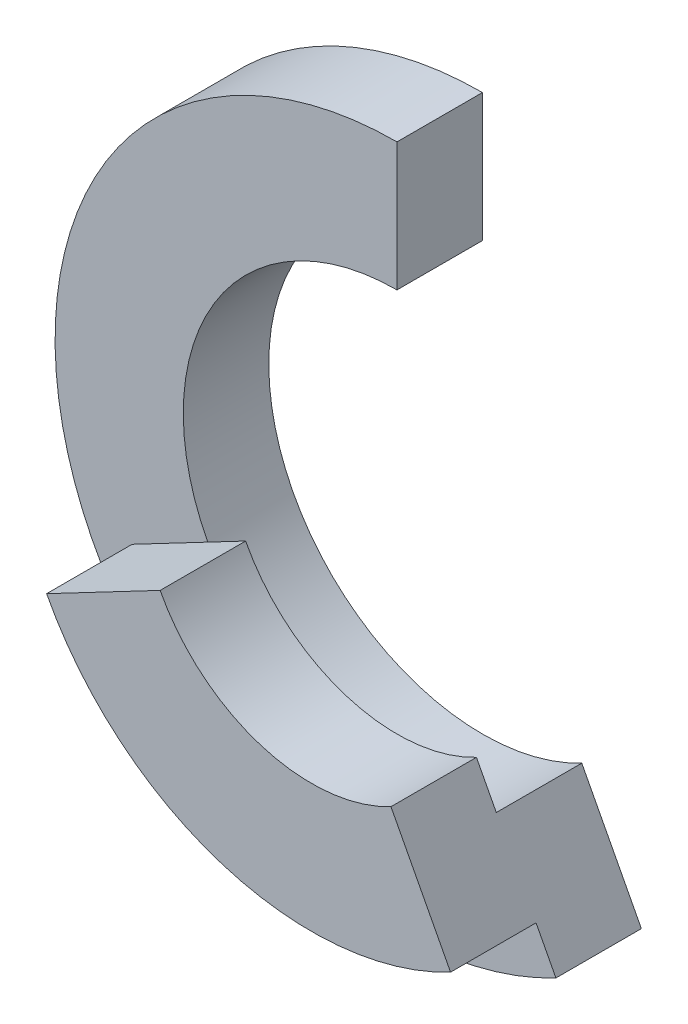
ISO-10303-21;
HEADER;
FILE_DESCRIPTION(('STEP AP214'),'2;1');
FILE_NAME('part.step','',(''),(''),'','','');
FILE_SCHEMA(('AUTOMOTIVE_DESIGN { 1 0 10303 214 1 1 1 1 }'));
ENDSEC;
DATA;
#1=APPLICATION_CONTEXT('core data for automotive mechanical design processes');
#2=APPLICATION_PROTOCOL_DEFINITION('international standard','automotive_design',2000,#1);
#3=PRODUCT_CONTEXT('',#1,'mechanical');
#4=PRODUCT('Part','Part','',(#3));
#5=PRODUCT_RELATED_PRODUCT_CATEGORY('part','',(#4));
#6=PRODUCT_DEFINITION_FORMATION('','',#4);
#7=PRODUCT_DEFINITION_CONTEXT('part definition',#1,'design');
#8=PRODUCT_DEFINITION('design','',#6,#7);
#9=PRODUCT_DEFINITION_SHAPE('','',#8);
#10=(LENGTH_UNIT() NAMED_UNIT(*) SI_UNIT(.MILLI.,.METRE.));
#11=(NAMED_UNIT(*) PLANE_ANGLE_UNIT() SI_UNIT($,.RADIAN.));
#12=(NAMED_UNIT(*) SI_UNIT($,.STERADIAN.) SOLID_ANGLE_UNIT());
#13=UNCERTAINTY_MEASURE_WITH_UNIT(LENGTH_MEASURE(1.E-05),#10,'distance_accuracy_value','');
#14=(GEOMETRIC_REPRESENTATION_CONTEXT(3) GLOBAL_UNCERTAINTY_ASSIGNED_CONTEXT((#13)) GLOBAL_UNIT_ASSIGNED_CONTEXT((#10,
#11,#12)) REPRESENTATION_CONTEXT('',''));
#15=CARTESIAN_POINT('',(0.,0.,0.));
#16=DIRECTION('',(0.,0.,1.));
#17=DIRECTION('',(1.,0.,0.));
#18=AXIS2_PLACEMENT_3D('',#15,#16,#17);
#19=CARTESIAN_POINT('',(0.,0.,0.));
#20=DIRECTION('',(0.,0.,1.));
#21=DIRECTION('',(1.,0.,0.));
#22=AXIS2_PLACEMENT_3D('',#19,#20,#21);
#23=PLANE('',#22);
#24=DIRECTION('',(0.464798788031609,-0.88541633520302,0.));
#25=VECTOR('',#24,1.);
#26=CARTESIAN_POINT('',(11.6199697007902,-22.1354083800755,0.));
#27=LINE('',#26,#25);
#28=CARTESIAN_POINT('',(16.2679575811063,-30.9895717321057,0.));
#29=VERTEX_POINT('',#28);
#30=CARTESIAN_POINT('',(18.5919515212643,-35.4166534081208,0.));
#31=VERTEX_POINT('',#30);
#32=EDGE_CURVE('E139',#29,#31,#27,.T.);
#33=ORIENTED_EDGE('',*,*,#32,.F.);
#34=CARTESIAN_POINT('',(0.,0.,0.));
#35=DIRECTION('',(0.,0.,1.));
#36=DIRECTION('',(1.,0.,0.));
#37=AXIS2_PLACEMENT_3D('',#34,#35,#36);
#38=CIRCLE('',#37,35.);
#39=CARTESIAN_POINT('',(-30.9895717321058,-16.2679575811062,0.));
#40=VERTEX_POINT('',#39);
#41=EDGE_CURVE('E124',#29,#40,#38,.F.);
#42=ORIENTED_EDGE('',*,*,#41,.T.);
#43=DIRECTION('',(0.885416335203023,0.464798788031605,0.));
#44=VECTOR('',#43,1.);
#45=CARTESIAN_POINT('',(-30.9895717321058,-16.2679575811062,0.));
#46=LINE('',#45,#44);
#47=CARTESIAN_POINT('',(-22.1354083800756,-11.6199697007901,0.));
#48=VERTEX_POINT('',#47);
#49=EDGE_CURVE('E107',#40,#48,#46,.T.);
#50=ORIENTED_EDGE('',*,*,#49,.T.);
#51=CARTESIAN_POINT('',(0.,0.,0.));
#52=DIRECTION('',(0.,0.,1.));
#53=DIRECTION('',(1.,0.,0.));
#54=AXIS2_PLACEMENT_3D('',#51,#52,#53);
#55=CIRCLE('',#54,25.);
#56=CARTESIAN_POINT('',(0.,25.,0.));
#57=VERTEX_POINT('',#56);
#58=EDGE_CURVE('E117',#48,#57,#55,.F.);
#59=ORIENTED_EDGE('',*,*,#58,.T.);
#60=DIRECTION('',(0.,-1.,0.));
#61=VECTOR('',#60,1.);
#62=CARTESIAN_POINT('',(0.,40.,0.));
#63=LINE('',#62,#61);
#64=CARTESIAN_POINT('',(0.,40.,0.));
#65=VERTEX_POINT('',#64);
#66=EDGE_CURVE('E134',#65,#57,#63,.T.);
#67=ORIENTED_EDGE('',*,*,#66,.F.);
#68=CARTESIAN_POINT('',(0.,0.,0.));
#69=DIRECTION('',(0.,0.,-1.));
#70=DIRECTION('',(-1.,0.,0.));
#71=AXIS2_PLACEMENT_3D('',#68,#69,#70);
#72=CIRCLE('',#71,40.);
#73=EDGE_CURVE('E137',#31,#65,#72,.T.);
#74=ORIENTED_EDGE('',*,*,#73,.F.);
#75=EDGE_LOOP('',(#33,#42,#50,#59,#67,#74));
#76=FACE_BOUND('',#75,.T.);
#77=ADVANCED_FACE('F31',(#76),#23,.T.);
#78=CARTESIAN_POINT('',(0.,0.,-10.));
#79=DIRECTION('',(0.,0.,1.));
#80=DIRECTION('',(1.,0.,0.));
#81=AXIS2_PLACEMENT_3D('',#78,#79,#80);
#82=CYLINDRICAL_SURFACE('',#81,25.);
#83=CARTESIAN_POINT('',(11.6199697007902,-22.1354083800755,0.));
#84=VERTEX_POINT('',#83);
#85=EDGE_CURVE('E35',#84,#48,#55,.F.);
#86=ORIENTED_EDGE('',*,*,#85,.F.);
#87=DIRECTION('',(0.,0.,1.));
#88=VECTOR('',#87,1.);
#89=CARTESIAN_POINT('',(11.6199697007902,-22.1354083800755,-10.));
#90=LINE('',#89,#88);
#91=CARTESIAN_POINT('',(11.6199697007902,-22.1354083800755,-10.));
#92=VERTEX_POINT('',#91);
#93=EDGE_CURVE('E11',#92,#84,#90,.T.);
#94=ORIENTED_EDGE('',*,*,#93,.F.);
#95=CARTESIAN_POINT('',(0.,0.,-10.));
#96=DIRECTION('',(0.,0.,1.));
#97=DIRECTION('',(1.,0.,0.));
#98=AXIS2_PLACEMENT_3D('',#95,#96,#97);
#99=CIRCLE('',#98,25.);
#100=CARTESIAN_POINT('',(0.,25.,-10.));
#101=VERTEX_POINT('',#100);
#102=EDGE_CURVE('E142',#92,#101,#99,.F.);
#103=ORIENTED_EDGE('',*,*,#102,.T.);
#104=DIRECTION('',(0.,0.,1.));
#105=VECTOR('',#104,1.);
#106=CARTESIAN_POINT('',(0.,25.,-10.));
#107=LINE('',#106,#105);
#108=EDGE_CURVE('E147',#101,#57,#107,.T.);
#109=ORIENTED_EDGE('',*,*,#108,.T.);
#110=ORIENTED_EDGE('',*,*,#58,.F.);
#111=EDGE_LOOP('',(#86,#94,#103,#109,#110));
#112=FACE_BOUND('',#111,.T.);
#113=ADVANCED_FACE('F33',(#112),#82,.F.);
#114=CARTESIAN_POINT('',(11.6199697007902,-22.1354083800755,-10.));
#115=DIRECTION('',(-0.885416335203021,-0.464798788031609,0.));
#116=DIRECTION('',(0.464798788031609,-0.88541633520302,0.));
#117=AXIS2_PLACEMENT_3D('',#114,#115,#116);
#118=PLANE('',#117);
#119=ORIENTED_EDGE('',*,*,#93,.T.);
#120=DIRECTION('',(0.464798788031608,-0.885416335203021,0.));
#121=VECTOR('',#120,1.);
#122=CARTESIAN_POINT('',(9.29597576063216,-17.7083267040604,0.));
#123=LINE('',#122,#121);
#124=CARTESIAN_POINT('',(9.29597576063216,-17.7083267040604,0.));
#125=VERTEX_POINT('',#124);
#126=EDGE_CURVE('E130',#125,#84,#123,.T.);
#127=ORIENTED_EDGE('',*,*,#126,.F.);
#128=DIRECTION('',(0.,0.,-1.));
#129=VECTOR('',#128,1.);
#130=CARTESIAN_POINT('',(9.29597576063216,-17.7083267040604,10.));
#131=LINE('',#130,#129);
#132=CARTESIAN_POINT('',(9.29597576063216,-17.7083267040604,10.));
#133=VERTEX_POINT('',#132);
#134=EDGE_CURVE('E121',#133,#125,#131,.T.);
#135=ORIENTED_EDGE('',*,*,#134,.F.);
#136=DIRECTION('',(0.464798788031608,-0.885416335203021,0.));
#137=VECTOR('',#136,1.);
#138=CARTESIAN_POINT('',(9.29597576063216,-17.7083267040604,10.));
#139=LINE('',#138,#137);
#140=CARTESIAN_POINT('',(16.2679575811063,-30.9895717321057,10.));
#141=VERTEX_POINT('',#140);
#142=EDGE_CURVE('E169',#133,#141,#139,.T.);
#143=ORIENTED_EDGE('',*,*,#142,.T.);
#144=DIRECTION('',(0.,0.,-1.));
#145=VECTOR('',#144,1.);
#146=CARTESIAN_POINT('',(16.2679575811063,-30.9895717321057,10.));
#147=LINE('',#146,#145);
#148=EDGE_CURVE('E149',#141,#29,#147,.T.);
#149=ORIENTED_EDGE('',*,*,#148,.T.);
#150=ORIENTED_EDGE('',*,*,#32,.T.);
#151=DIRECTION('',(0.,0.,1.));
#152=VECTOR('',#151,1.);
#153=CARTESIAN_POINT('',(18.5919515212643,-35.4166534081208,-10.));
#154=LINE('',#153,#152);
#155=CARTESIAN_POINT('',(18.5919515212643,-35.4166534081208,-10.));
#156=VERTEX_POINT('',#155);
#157=EDGE_CURVE('E41',#156,#31,#154,.T.);
#158=ORIENTED_EDGE('',*,*,#157,.F.);
#159=DIRECTION('',(0.464798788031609,-0.88541633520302,0.));
#160=VECTOR('',#159,1.);
#161=CARTESIAN_POINT('',(11.6199697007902,-22.1354083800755,-10.));
#162=LINE('',#161,#160);
#163=EDGE_CURVE('E178',#92,#156,#162,.T.);
#164=ORIENTED_EDGE('',*,*,#163,.F.);
#165=EDGE_LOOP('',(#119,#127,#135,#143,#149,#150,#158,#164));
#166=FACE_BOUND('',#165,.T.);
#167=ADVANCED_FACE('F176',(#166),#118,.F.);
#168=CARTESIAN_POINT('',(0.,0.,-10.));
#169=DIRECTION('',(0.,0.,1.));
#170=DIRECTION('',(1.,0.,0.));
#171=AXIS2_PLACEMENT_3D('',#168,#169,#170);
#172=CYLINDRICAL_SURFACE('',#171,40.);
#173=ORIENTED_EDGE('',*,*,#73,.T.);
#174=DIRECTION('',(0.,0.,1.));
#175=VECTOR('',#174,1.);
#176=CARTESIAN_POINT('',(0.,40.,-10.));
#177=LINE('',#176,#175);
#178=CARTESIAN_POINT('',(0.,40.,-10.));
#179=VERTEX_POINT('',#178);
#180=EDGE_CURVE('E188',#179,#65,#177,.T.);
#181=ORIENTED_EDGE('',*,*,#180,.F.);
#182=CARTESIAN_POINT('',(0.,0.,-10.));
#183=DIRECTION('',(0.,0.,-1.));
#184=DIRECTION('',(-1.,0.,0.));
#185=AXIS2_PLACEMENT_3D('',#182,#183,#184);
#186=CIRCLE('',#185,40.);
#187=EDGE_CURVE('E196',#156,#179,#186,.T.);
#188=ORIENTED_EDGE('',*,*,#187,.F.);
#189=ORIENTED_EDGE('',*,*,#157,.T.);
#190=EDGE_LOOP('',(#173,#181,#188,#189));
#191=FACE_BOUND('',#190,.T.);
#192=ADVANCED_FACE('F199',(#191),#172,.T.);
#193=CARTESIAN_POINT('',(0.,40.,-10.));
#194=DIRECTION('',(-1.,0.,0.));
#195=DIRECTION('',(0.,-1.,0.));
#196=AXIS2_PLACEMENT_3D('',#193,#194,#195);
#197=PLANE('',#196);
#198=ORIENTED_EDGE('',*,*,#66,.T.);
#199=ORIENTED_EDGE('',*,*,#108,.F.);
#200=DIRECTION('',(0.,-1.,0.));
#201=VECTOR('',#200,1.);
#202=CARTESIAN_POINT('',(0.,40.,-10.));
#203=LINE('',#202,#201);
#204=EDGE_CURVE('E189',#179,#101,#203,.T.);
#205=ORIENTED_EDGE('',*,*,#204,.F.);
#206=ORIENTED_EDGE('',*,*,#180,.T.);
#207=EDGE_LOOP('',(#198,#199,#205,#206));
#208=FACE_BOUND('',#207,.T.);
#209=ADVANCED_FACE('F185',(#208),#197,.F.);
#210=CARTESIAN_POINT('',(0.,0.,-10.));
#211=DIRECTION('',(0.,0.,1.));
#212=DIRECTION('',(1.,0.,0.));
#213=AXIS2_PLACEMENT_3D('',#210,#211,#212);
#214=PLANE('',#213);
#215=ORIENTED_EDGE('',*,*,#102,.F.);
#216=ORIENTED_EDGE('',*,*,#163,.T.);
#217=ORIENTED_EDGE('',*,*,#187,.T.);
#218=ORIENTED_EDGE('',*,*,#204,.T.);
#219=EDGE_LOOP('',(#215,#216,#217,#218));
#220=FACE_BOUND('',#219,.T.);
#221=ADVANCED_FACE('F198',(#220),#214,.F.);
#222=CARTESIAN_POINT('',(0.,0.,0.));
#223=DIRECTION('',(0.,0.,1.));
#224=DIRECTION('',(1.,0.,0.));
#225=AXIS2_PLACEMENT_3D('',#222,#223,#224);
#226=PLANE('',#225);
#227=ORIENTED_EDGE('',*,*,#126,.T.);
#228=ORIENTED_EDGE('',*,*,#85,.T.);
#229=CARTESIAN_POINT('',(-17.7083267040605,-9.2959757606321,0.));
#230=VERTEX_POINT('',#229);
#231=EDGE_CURVE('E49',#48,#230,#46,.T.);
#232=ORIENTED_EDGE('',*,*,#231,.T.);
#233=CARTESIAN_POINT('',(0.,0.,0.));
#234=DIRECTION('',(0.,0.,1.));
#235=DIRECTION('',(1.,0.,0.));
#236=AXIS2_PLACEMENT_3D('',#233,#234,#235);
#237=CIRCLE('',#236,20.);
#238=EDGE_CURVE('E104',#125,#230,#237,.F.);
#239=ORIENTED_EDGE('',*,*,#238,.F.);
#240=EDGE_LOOP('',(#227,#228,#232,#239));
#241=FACE_BOUND('',#240,.T.);
#242=ADVANCED_FACE('F102',(#241),#226,.F.);
#243=CARTESIAN_POINT('',(0.,0.,10.));
#244=DIRECTION('',(0.,0.,-1.));
#245=DIRECTION('',(-1.,0.,0.));
#246=AXIS2_PLACEMENT_3D('',#243,#244,#245);
#247=CYLINDRICAL_SURFACE('',#246,20.);
#248=ORIENTED_EDGE('',*,*,#238,.T.);
#249=DIRECTION('',(0.,0.,-1.));
#250=VECTOR('',#249,1.);
#251=CARTESIAN_POINT('',(-17.7083267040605,-9.2959757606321,10.));
#252=LINE('',#251,#250);
#253=CARTESIAN_POINT('',(-17.7083267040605,-9.2959757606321,10.));
#254=VERTEX_POINT('',#253);
#255=EDGE_CURVE('E111',#254,#230,#252,.T.);
#256=ORIENTED_EDGE('',*,*,#255,.F.);
#257=CARTESIAN_POINT('',(0.,0.,10.));
#258=DIRECTION('',(0.,0.,1.));
#259=DIRECTION('',(1.,0.,0.));
#260=AXIS2_PLACEMENT_3D('',#257,#258,#259);
#261=CIRCLE('',#260,20.);
#262=EDGE_CURVE('E127',#133,#254,#261,.F.);
#263=ORIENTED_EDGE('',*,*,#262,.F.);
#264=ORIENTED_EDGE('',*,*,#134,.T.);
#265=EDGE_LOOP('',(#248,#256,#263,#264));
#266=FACE_BOUND('',#265,.T.);
#267=ADVANCED_FACE('F120',(#266),#247,.F.);
#268=CARTESIAN_POINT('',(-30.9895717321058,-16.2679575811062,10.));
#269=DIRECTION('',(-0.464798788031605,0.885416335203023,0.));
#270=DIRECTION('',(-0.885416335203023,-0.464798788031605,0.));
#271=AXIS2_PLACEMENT_3D('',#268,#269,#270);
#272=PLANE('',#271);
#273=ORIENTED_EDGE('',*,*,#49,.F.);
#274=DIRECTION('',(0.,0.,-1.));
#275=VECTOR('',#274,1.);
#276=CARTESIAN_POINT('',(-30.9895717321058,-16.2679575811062,10.));
#277=LINE('',#276,#275);
#278=CARTESIAN_POINT('',(-30.9895717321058,-16.2679575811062,10.));
#279=VERTEX_POINT('',#278);
#280=EDGE_CURVE('E118',#279,#40,#277,.T.);
#281=ORIENTED_EDGE('',*,*,#280,.F.);
#282=DIRECTION('',(0.885416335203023,0.464798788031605,0.));
#283=VECTOR('',#282,1.);
#284=CARTESIAN_POINT('',(-30.9895717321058,-16.2679575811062,10.));
#285=LINE('',#284,#283);
#286=EDGE_CURVE('E114',#279,#254,#285,.T.);
#287=ORIENTED_EDGE('',*,*,#286,.T.);
#288=ORIENTED_EDGE('',*,*,#255,.T.);
#289=ORIENTED_EDGE('',*,*,#231,.F.);
#290=EDGE_LOOP('',(#273,#281,#287,#288,#289));
#291=FACE_BOUND('',#290,.T.);
#292=ADVANCED_FACE('F112',(#291),#272,.T.);
#293=CARTESIAN_POINT('',(0.,0.,10.));
#294=DIRECTION('',(0.,0.,-1.));
#295=DIRECTION('',(-1.,0.,0.));
#296=AXIS2_PLACEMENT_3D('',#293,#294,#295);
#297=CYLINDRICAL_SURFACE('',#296,35.);
#298=ORIENTED_EDGE('',*,*,#41,.F.);
#299=ORIENTED_EDGE('',*,*,#148,.F.);
#300=CARTESIAN_POINT('',(0.,0.,10.));
#301=DIRECTION('',(0.,0.,1.));
#302=DIRECTION('',(1.,0.,0.));
#303=AXIS2_PLACEMENT_3D('',#300,#301,#302);
#304=CIRCLE('',#303,35.);
#305=EDGE_CURVE('E166',#141,#279,#304,.F.);
#306=ORIENTED_EDGE('',*,*,#305,.T.);
#307=ORIENTED_EDGE('',*,*,#280,.T.);
#308=EDGE_LOOP('',(#298,#299,#306,#307));
#309=FACE_BOUND('',#308,.T.);
#310=ADVANCED_FACE('F163',(#309),#297,.T.);
#311=CARTESIAN_POINT('',(0.,0.,10.));
#312=DIRECTION('',(0.,0.,1.));
#313=DIRECTION('',(1.,0.,0.));
#314=AXIS2_PLACEMENT_3D('',#311,#312,#313);
#315=PLANE('',#314);
#316=ORIENTED_EDGE('',*,*,#262,.T.);
#317=ORIENTED_EDGE('',*,*,#286,.F.);
#318=ORIENTED_EDGE('',*,*,#305,.F.);
#319=ORIENTED_EDGE('',*,*,#142,.F.);
#320=EDGE_LOOP('',(#316,#317,#318,#319));
#321=FACE_BOUND('',#320,.T.);
#322=ADVANCED_FACE('F174',(#321),#315,.T.);
#323=CLOSED_SHELL('',(#77,#113,#167,#192,#209,#221,#242,#267,#292,#310,#322));
#324=MANIFOLD_SOLID_BREP('B2',#323);
#325=ADVANCED_BREP_SHAPE_REPRESENTATION('',(#18,#324),#14);
#326=SHAPE_DEFINITION_REPRESENTATION(#9,#325);
ENDSEC;
END-ISO-10303-21;
